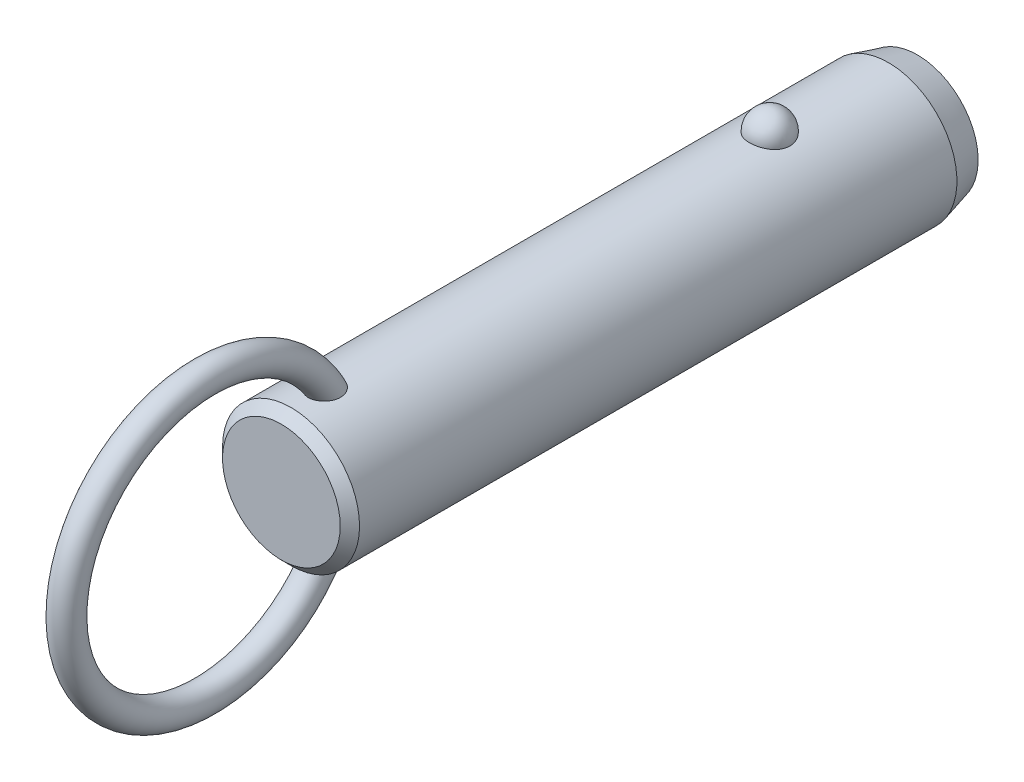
ISO-10303-21;
HEADER;
FILE_DESCRIPTION(('STEP AP214'),'2;1');
FILE_NAME('part.step','',(''),(''),'','','');
FILE_SCHEMA(('AUTOMOTIVE_DESIGN { 1 0 10303 214 1 1 1 1 }'));
ENDSEC;
DATA;
#1=APPLICATION_CONTEXT('core data for automotive mechanical design processes');
#2=APPLICATION_PROTOCOL_DEFINITION('international standard','automotive_design',2000,#1);
#3=PRODUCT_CONTEXT('',#1,'mechanical');
#4=PRODUCT('Part','Part','',(#3));
#5=PRODUCT_RELATED_PRODUCT_CATEGORY('part','',(#4));
#6=PRODUCT_DEFINITION_FORMATION('','',#4);
#7=PRODUCT_DEFINITION_CONTEXT('part definition',#1,'design');
#8=PRODUCT_DEFINITION('design','',#6,#7);
#9=PRODUCT_DEFINITION_SHAPE('','',#8);
#10=(LENGTH_UNIT() NAMED_UNIT(*) SI_UNIT(.MILLI.,.METRE.));
#11=(NAMED_UNIT(*) PLANE_ANGLE_UNIT() SI_UNIT($,.RADIAN.));
#12=(NAMED_UNIT(*) SI_UNIT($,.STERADIAN.) SOLID_ANGLE_UNIT());
#13=UNCERTAINTY_MEASURE_WITH_UNIT(LENGTH_MEASURE(1.E-05),#10,'distance_accuracy_value','');
#14=(GEOMETRIC_REPRESENTATION_CONTEXT(3) GLOBAL_UNCERTAINTY_ASSIGNED_CONTEXT((#13)) GLOBAL_UNIT_ASSIGNED_CONTEXT((#10,
#11,#12)) REPRESENTATION_CONTEXT('',''));
#15=CARTESIAN_POINT('',(0.,0.,0.));
#16=DIRECTION('',(0.,0.,1.));
#17=DIRECTION('',(1.,0.,0.));
#18=AXIS2_PLACEMENT_3D('',#15,#16,#17);
#19=CARTESIAN_POINT('',(0.,0.,40.6));
#20=DIRECTION('',(0.,0.,-1.));
#21=DIRECTION('',(-1.,0.,0.));
#22=AXIS2_PLACEMENT_3D('',#19,#20,#21);
#23=CYLINDRICAL_SURFACE('',#22,7.1);
#24=CARTESIAN_POINT('',(2.0769088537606,6.78943661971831,-2.1));
#25=CARTESIAN_POINT('',(2.07690739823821,6.78943796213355,-1.98268154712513));
#26=CARTESIAN_POINT('',(2.06738130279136,6.79237331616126,-1.86534506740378));
#27=CARTESIAN_POINT('',(2.0295040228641,6.8037853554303,-1.63400788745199));
#28=CARTESIAN_POINT('',(2.00114757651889,6.81226358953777,-1.52000812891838));
#29=CARTESIAN_POINT('',(1.92632025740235,6.83379798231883,-1.29863433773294));
#30=CARTESIAN_POINT('',(1.87985726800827,6.84685214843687,-1.19125744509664));
#31=CARTESIAN_POINT('',(1.76995205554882,6.87608091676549,-0.98604657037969));
#32=CARTESIAN_POINT('',(1.70650980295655,6.8922555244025,-0.88821260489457));
#33=CARTESIAN_POINT('',(1.5638119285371,6.92602930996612,-0.704242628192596));
#34=CARTESIAN_POINT('',(1.4844714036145,6.94363582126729,-0.618173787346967));
#35=CARTESIAN_POINT('',(1.31221746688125,6.97823658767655,-0.460740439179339));
#36=CARTESIAN_POINT('',(1.21930409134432,6.99523084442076,-0.389375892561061));
#37=CARTESIAN_POINT('',(1.02268781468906,7.02666176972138,-0.263547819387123));
#38=CARTESIAN_POINT('',(0.91902009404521,7.04110638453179,-0.209031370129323));
#39=CARTESIAN_POINT('',(0.703548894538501,7.06588726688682,-0.118163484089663));
#40=CARTESIAN_POINT('',(0.591746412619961,7.07622403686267,-0.0818098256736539));
#41=CARTESIAN_POINT('',(0.365557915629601,7.09147068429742,-0.0288711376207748));
#42=CARTESIAN_POINT('',(0.251267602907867,7.09648447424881,-0.0119070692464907));
#43=CARTESIAN_POINT('',(0.0213499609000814,7.10089837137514,0.00304925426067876));
#44=CARTESIAN_POINT('',(-0.0942772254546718,7.10029907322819,0.00104351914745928));
#45=CARTESIAN_POINT('',(-0.321651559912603,7.09360829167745,-0.0216931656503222));
#46=CARTESIAN_POINT('',(-0.433431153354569,7.08760388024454,-0.0421272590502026));
#47=CARTESIAN_POINT('',(-0.651862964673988,7.07086131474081,-0.100729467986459));
#48=CARTESIAN_POINT('',(-0.758515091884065,7.06012307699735,-0.138897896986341));
#49=CARTESIAN_POINT('',(-0.964449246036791,7.03496097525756,-0.232213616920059));
#50=CARTESIAN_POINT('',(-1.06368095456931,7.02051445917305,-0.287465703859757));
#51=CARTESIAN_POINT('',(-1.25145353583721,6.98948740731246,-0.413383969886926));
#52=CARTESIAN_POINT('',(-1.33999321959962,6.97290663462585,-0.48405186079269));
#53=CARTESIAN_POINT('',(-1.50591604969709,6.93898770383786,-0.640594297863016));
#54=CARTESIAN_POINT('',(-1.58302488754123,6.92164094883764,-0.726757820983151));
#55=CARTESIAN_POINT('',(-1.72189320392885,6.8884103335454,-0.91092752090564));
#56=CARTESIAN_POINT('',(-1.78365144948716,6.87252659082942,-1.008934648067));
#57=CARTESIAN_POINT('',(-1.89101272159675,6.84377189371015,-1.21549497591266));
#58=CARTESIAN_POINT('',(-1.93639553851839,6.83094274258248,-1.32416860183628));
#59=CARTESIAN_POINT('',(-2.00874275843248,6.81002070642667,-1.54791500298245));
#60=CARTESIAN_POINT('',(-2.03570774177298,6.80192767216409,-1.66298757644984));
#61=CARTESIAN_POINT('',(-2.07047276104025,6.7914266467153,-1.89571453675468));
#62=CARTESIAN_POINT('',(-2.07835878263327,6.78899315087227,-2.01335491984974));
#63=CARTESIAN_POINT('',(-2.07502083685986,6.79001409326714,-2.24833570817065));
#64=CARTESIAN_POINT('',(-2.06379746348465,6.7934683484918,-2.36567612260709));
#65=CARTESIAN_POINT('',(-2.02263913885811,6.80583442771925,-2.59603194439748));
#66=CARTESIAN_POINT('',(-1.99281127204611,6.81471501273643,-2.70906820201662));
#67=CARTESIAN_POINT('',(-1.91526639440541,6.83691232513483,-2.92836575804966));
#68=CARTESIAN_POINT('',(-1.8675486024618,6.85022924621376,-3.03462676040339));
#69=CARTESIAN_POINT('',(-1.75504492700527,6.87991336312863,-3.23806487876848));
#70=CARTESIAN_POINT('',(-1.69015924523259,6.89629822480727,-3.33518422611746));
#71=CARTESIAN_POINT('',(-1.54505404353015,6.93024852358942,-3.51697105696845));
#72=CARTESIAN_POINT('',(-1.46483385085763,6.94781401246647,-3.60163799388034));
#73=CARTESIAN_POINT('',(-1.29071406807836,6.98225977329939,-3.75654119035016));
#74=CARTESIAN_POINT('',(-1.19675650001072,6.99913673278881,-3.82671308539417));
#75=CARTESIAN_POINT('',(-0.997940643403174,7.03023618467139,-3.9501837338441));
#76=CARTESIAN_POINT('',(-0.89308318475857,7.04445887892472,-4.00348377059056));
#77=CARTESIAN_POINT('',(-0.676902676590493,7.06848365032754,-4.09107242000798));
#78=CARTESIAN_POINT('',(-0.565686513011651,7.0783430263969,-4.12560889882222));
#79=CARTESIAN_POINT('',(-0.338739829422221,7.09282534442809,-4.17575450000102));
#80=CARTESIAN_POINT('',(-0.223009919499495,7.09744899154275,-4.19136617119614));
#81=CARTESIAN_POINT('',(0.00707628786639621,7.10090930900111,-4.20307965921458));
#82=CARTESIAN_POINT('',(0.121410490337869,7.09986531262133,-4.19958377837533));
#83=CARTESIAN_POINT('',(0.347815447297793,7.092380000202,-4.17411564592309));
#84=CARTESIAN_POINT('',(0.459886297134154,7.08593891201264,-4.15214417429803));
#85=CARTESIAN_POINT('',(0.678084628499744,7.06838983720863,-4.09049562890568));
#86=CARTESIAN_POINT('',(0.784237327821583,7.05730369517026,-4.05090137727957));
#87=CARTESIAN_POINT('',(0.988305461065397,7.03163139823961,-3.95511447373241));
#88=CARTESIAN_POINT('',(1.08622031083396,7.01704499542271,-3.89892064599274));
#89=CARTESIAN_POINT('',(1.27284490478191,6.98562668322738,-3.77035541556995));
#90=CARTESIAN_POINT('',(1.36137372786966,6.96876135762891,-3.69772964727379));
#91=CARTESIAN_POINT('',(1.52509486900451,6.93477412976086,-3.53878279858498));
#92=CARTESIAN_POINT('',(1.60028496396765,6.91765218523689,-3.45245943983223));
#93=CARTESIAN_POINT('',(1.73681688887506,6.88465753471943,-3.26658774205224));
#94=CARTESIAN_POINT('',(1.79785966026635,6.86881574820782,-3.16681408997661));
#95=CARTESIAN_POINT('',(1.90265327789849,6.84053157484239,-2.95814408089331));
#96=CARTESIAN_POINT('',(1.94640861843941,6.82808830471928,-2.84925010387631));
#97=CARTESIAN_POINT('',(2.01274378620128,6.80881460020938,-2.63454318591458));
#98=CARTESIAN_POINT('',(2.03676193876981,6.80160856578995,-2.52920574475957));
#99=CARTESIAN_POINT('',(2.06884490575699,6.79191902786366,-2.3159172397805));
#100=CARTESIAN_POINT('',(2.07691019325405,6.78943538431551,-2.20796625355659));
#101=CARTESIAN_POINT('',(2.0769088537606,6.78943661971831,-2.1));
#102=B_SPLINE_CURVE_WITH_KNOTS('',3,(#24,#25,#26,#27,#28,#29,#30,#31,#32,#33,#34,#35,#36,#37,
#38,#39,#40,#41,#42,#43,#44,#45,#46,#47,#48,#49,#50,#51,#52,#53,#54,#55,#56,#57,#58,#59,#60,#61,
#62,#63,#64,#65,#66,#67,#68,#69,#70,#71,#72,#73,#74,#75,#76,#77,#78,#79,#80,#81,#82,#83,#84,#85,
#86,#87,#88,#89,#90,#91,#92,#93,#94,#95,#96,#97,#98,#99,#100,#101),.UNSPECIFIED.,.T.,.F.,(4,2,2,
2,2,2,2,2,2,2,2,2,2,2,2,2,2,2,2,2,2,2,2,2,2,2,2,2,2,2,2,2,2,2,2,2,2,2,4),(0.,0.351568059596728,
0.703234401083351,1.05474780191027,1.40626181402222,1.75970563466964,2.11314851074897,
2.4654696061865,2.81774759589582,3.16301449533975,3.50824481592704,3.84801136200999,
4.18778391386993,4.52968352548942,4.87162112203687,5.22076181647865,5.56993054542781,
5.92363364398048,6.27732559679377,6.62942052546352,6.98150450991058,7.33158042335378,
7.68167162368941,8.03384443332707,8.38603269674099,8.73975272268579,9.09344583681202,
9.44234545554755,9.79119807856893,10.1327344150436,10.4742563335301,10.8141898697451,
11.1541474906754,11.4997793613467,11.8454687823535,12.1979079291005,12.5502553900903,
12.8738073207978,13.1973496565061),.UNSPECIFIED.);
#103=CARTESIAN_POINT('',(2.0769088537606,6.78943661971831,-2.1));
#104=VERTEX_POINT('',#103);
#105=EDGE_CURVE('E41',#104,#104,#102,.T.);
#106=ORIENTED_EDGE('',*,*,#105,.T.);
#107=EDGE_LOOP('',(#106));
#108=FACE_BOUND('',#107,.T.);
#109=CARTESIAN_POINT('',(0.,0.,47.52));
#110=DIRECTION('',(0.,0.,1.));
#111=DIRECTION('',(1.,0.,0.));
#112=AXIS2_PLACEMENT_3D('',#109,#110,#111);
#113=CIRCLE('',#112,7.1);
#114=CARTESIAN_POINT('',(7.1,0.,47.52));
#115=VERTEX_POINT('',#114);
#116=EDGE_CURVE('E10',#115,#115,#113,.F.);
#117=ORIENTED_EDGE('',*,*,#116,.T.);
#118=EDGE_LOOP('',(#117));
#119=FACE_BOUND('',#118,.T.);
#120=CARTESIAN_POINT('',(-0.429539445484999,-7.08699541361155,42.3429212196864));
#121=CARTESIAN_POINT('',(-0.50833166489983,-7.08221999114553,42.3668764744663));
#122=CARTESIAN_POINT('',(-0.585039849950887,-7.07624016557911,42.3974570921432));
#123=CARTESIAN_POINT('',(-0.732082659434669,-7.06254296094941,42.4710242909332));
#124=CARTESIAN_POINT('',(-0.802417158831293,-7.05482554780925,42.5140111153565));
#125=CARTESIAN_POINT('',(-0.934722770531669,-7.03851844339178,42.6111135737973));
#126=CARTESIAN_POINT('',(-0.996700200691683,-7.02992941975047,42.6652207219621));
#127=CARTESIAN_POINT('',(-1.11079942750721,-7.01280697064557,42.7829676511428));
#128=CARTESIAN_POINT('',(-1.16292136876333,-7.00427354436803,42.8466072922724));
#129=CARTESIAN_POINT('',(-1.25705660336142,-6.98799959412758,42.9826870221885));
#130=CARTESIAN_POINT('',(-1.29888032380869,-6.98027525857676,43.0552598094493));
#131=CARTESIAN_POINT('',(-1.37069920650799,-6.96652886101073,43.2061686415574));
#132=CARTESIAN_POINT('',(-1.40069157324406,-6.96050720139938,43.2845060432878));
#133=CARTESIAN_POINT('',(-1.45043507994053,-6.95031881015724,43.4501903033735));
#134=CARTESIAN_POINT('',(-1.46937115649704,-6.94630231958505,43.5377897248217));
#135=CARTESIAN_POINT('',(-1.49424917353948,-6.94099239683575,43.7148714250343));
#136=CARTESIAN_POINT('',(-1.50018601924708,-6.93970003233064,43.8043544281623));
#137=CARTESIAN_POINT('',(-1.49978214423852,-6.93978815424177,43.9940607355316));
#138=CARTESIAN_POINT('',(-1.49187639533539,-6.94150934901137,44.094279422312));
#139=CARTESIAN_POINT('',(-1.46177925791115,-6.94790814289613,44.2924798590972));
#140=CARTESIAN_POINT('',(-1.43957541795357,-6.95258831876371,44.390459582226));
#141=CARTESIAN_POINT('',(-1.37783293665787,-6.96510647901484,44.5953629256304));
#142=CARTESIAN_POINT('',(-1.33634073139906,-6.97328848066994,44.7016801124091));
#143=CARTESIAN_POINT('',(-1.23686994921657,-6.99161706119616,44.9061777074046));
#144=CARTESIAN_POINT('',(-1.17889192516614,-7.00176357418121,45.0043583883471));
#145=CARTESIAN_POINT('',(-1.05875124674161,-7.02082898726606,45.1723743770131));
#146=CARTESIAN_POINT('',(-0.99924764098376,-7.02963746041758,45.2441230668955));
#147=CARTESIAN_POINT('',(-0.86949477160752,-7.04686074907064,45.3771959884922));
#148=CARTESIAN_POINT('',(-0.799263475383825,-7.05527619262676,45.4385372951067));
#149=CARTESIAN_POINT('',(-0.665408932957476,-7.06899457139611,45.5351316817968));
#150=CARTESIAN_POINT('',(-0.603817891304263,-7.07457275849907,45.5731512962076));
#151=CARTESIAN_POINT('',(-0.475172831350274,-7.08437420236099,45.6387581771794));
#152=CARTESIAN_POINT('',(-0.408123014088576,-7.08859848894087,45.6663533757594));
#153=CARTESIAN_POINT('',(-0.269431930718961,-7.09522749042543,45.7092569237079));
#154=CARTESIAN_POINT('',(-0.197757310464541,-7.09761688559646,45.7244618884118));
#155=CARTESIAN_POINT('',(-0.0527849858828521,-7.10017268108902,45.7407168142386));
#156=CARTESIAN_POINT('',(0.0205115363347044,-7.10034065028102,45.7417767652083));
#157=CARTESIAN_POINT('',(0.156426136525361,-7.09855986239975,45.7304619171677));
#158=CARTESIAN_POINT('',(0.219199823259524,-7.09688191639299,45.7198060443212));
#159=CARTESIAN_POINT('',(0.342134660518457,-7.09201880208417,45.6885379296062));
#160=CARTESIAN_POINT('',(0.402295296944,-7.08883333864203,45.6679237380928));
#161=CARTESIAN_POINT('',(0.52068738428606,-7.08113868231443,45.6172125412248));
#162=CARTESIAN_POINT('',(0.57879126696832,-7.07658958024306,45.5868272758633));
#163=CARTESIAN_POINT('',(0.690173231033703,-7.06659708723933,45.5183678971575));
#164=CARTESIAN_POINT('',(0.743447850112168,-7.061153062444,45.4802883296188));
#165=CARTESIAN_POINT('',(0.870947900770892,-7.04680292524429,45.3765929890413));
#166=CARTESIAN_POINT('',(0.941828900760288,-7.0375580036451,45.3068972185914));
#167=CARTESIAN_POINT('',(1.07136606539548,-7.01900793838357,45.1569450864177));
#168=CARTESIAN_POINT('',(1.13000013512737,-7.00970271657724,45.0766700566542));
#169=CARTESIAN_POINT('',(1.23579584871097,-6.99183327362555,44.9068997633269));
#170=CARTESIAN_POINT('',(1.28274271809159,-6.98328455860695,44.8172696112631));
#171=CARTESIAN_POINT('',(1.36351442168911,-6.96796352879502,44.6321763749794));
#172=CARTESIAN_POINT('',(1.39733971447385,-6.96119115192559,44.5367134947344));
#173=CARTESIAN_POINT('',(1.45579181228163,-6.94922464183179,44.3253092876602));
#174=CARTESIAN_POINT('',(1.47790145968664,-6.94449000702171,44.208631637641));
#175=CARTESIAN_POINT('',(1.50168752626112,-6.93938731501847,43.9730153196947));
#176=CARTESIAN_POINT('',(1.50336085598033,-6.93901991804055,43.8540763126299));
#177=CARTESIAN_POINT('',(1.48486516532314,-6.9430010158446,43.6236079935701));
#178=CARTESIAN_POINT('',(1.46573441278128,-6.9471253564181,43.5119958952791));
#179=CARTESIAN_POINT('',(1.40606892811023,-6.95944667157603,43.2948868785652));
#180=CARTESIAN_POINT('',(1.3655644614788,-6.96763788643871,43.1893815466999));
#181=CARTESIAN_POINT('',(1.27082700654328,-6.98548038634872,43.0042879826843));
#182=CARTESIAN_POINT('',(1.21949810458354,-6.99473841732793,42.9231719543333));
#183=CARTESIAN_POINT('',(1.10242050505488,-7.01414069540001,42.7722278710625));
#184=CARTESIAN_POINT('',(1.03668119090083,-7.02428436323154,42.7023925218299));
#185=CARTESIAN_POINT('',(0.900559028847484,-7.04295285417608,42.5835735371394));
#186=CARTESIAN_POINT('',(0.831428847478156,-7.05153466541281,42.5331573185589));
#187=CARTESIAN_POINT('',(0.685291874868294,-7.06723150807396,42.4451429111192));
#188=CARTESIAN_POINT('',(0.608287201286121,-7.0743469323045,42.4075412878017));
#189=CARTESIAN_POINT('',(0.451878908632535,-7.08602232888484,42.3474915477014));
#190=CARTESIAN_POINT('',(0.372686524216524,-7.09067127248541,42.3245088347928));
#191=CARTESIAN_POINT('',(0.211477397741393,-7.09730788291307,42.2920357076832));
#192=CARTESIAN_POINT('',(0.129460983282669,-7.09929585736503,42.2825437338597));
#193=CARTESIAN_POINT('',(-0.0332905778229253,-7.10037858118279,42.2773517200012));
#194=CARTESIAN_POINT('',(-0.114016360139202,-7.09953334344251,42.2813656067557));
#195=CARTESIAN_POINT('',(-0.273670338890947,-7.09517338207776,42.3024540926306));
#196=CARTESIAN_POINT('',(-0.352598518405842,-7.09165863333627,42.3195288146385));
#197=CARTESIAN_POINT('',(-0.429539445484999,-7.08699541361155,42.3429212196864));
#198=B_SPLINE_CURVE_WITH_KNOTS('',3,(#120,#121,#122,#123,#124,#125,#126,#127,#128,#129,#130,
#131,#132,#133,#134,#135,#136,#137,#138,#139,#140,#141,#142,#143,#144,#145,#146,#147,#148,#149,
#150,#151,#152,#153,#154,#155,#156,#157,#158,#159,#160,#161,#162,#163,#164,#165,#166,#167,#168,
#169,#170,#171,#172,#173,#174,#175,#176,#177,#178,#179,#180,#181,#182,#183,#184,#185,#186,#187,
#188,#189,#190,#191,#192,#193,#194,#195,#196,#197),.UNSPECIFIED.,.T.,.F.,(4,2,2,2,2,2,2,2,2,2,2,
2,2,2,2,2,2,2,2,2,2,2,2,2,2,2,2,2,2,2,2,2,2,2,2,2,2,2,4),(0.,0.247183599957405,
0.494372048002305,0.741372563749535,0.988369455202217,1.23962059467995,1.49093106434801,
1.75897818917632,2.02713035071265,2.32758265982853,2.62829697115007,2.9700873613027,
3.31186629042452,3.5917531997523,3.87117637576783,4.08813841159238,4.30493502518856,
4.52352259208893,4.74195577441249,4.93215328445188,5.12238804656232,5.31884850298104,
5.51544871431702,5.81332317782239,6.11173048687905,6.41527266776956,6.71880423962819,
7.07358156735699,7.42841252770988,7.76631485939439,8.10373999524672,8.39142246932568,
8.67891817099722,8.93560332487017,9.19221962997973,9.43881106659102,9.68537399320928,
9.92674752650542,10.1681233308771),.UNSPECIFIED.);
#199=CARTESIAN_POINT('',(-0.429539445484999,-7.08699541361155,42.3429212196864));
#200=VERTEX_POINT('',#199);
#201=EDGE_CURVE('E60',#200,#200,#198,.T.);
#202=ORIENTED_EDGE('',*,*,#201,.T.);
#203=EDGE_LOOP('',(#202));
#204=FACE_BOUND('',#203,.T.);
#205=CARTESIAN_POINT('',(-0.429539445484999,7.08699541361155,42.3429212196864));
#206=CARTESIAN_POINT('',(-0.351665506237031,7.09171429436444,42.3192469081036));
#207=CARTESIAN_POINT('',(-0.271733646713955,7.09525896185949,42.3020369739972));
#208=CARTESIAN_POINT('',(-0.110026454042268,7.09960839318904,42.2810059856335));
#209=CARTESIAN_POINT('',(-0.0282502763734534,7.10041187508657,42.277191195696));
#210=CARTESIAN_POINT('',(0.134782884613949,7.09918849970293,42.283059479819));
#211=CARTESIAN_POINT('',(0.216039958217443,7.09716214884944,42.2927401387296));
#212=CARTESIAN_POINT('',(0.375730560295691,7.09050177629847,42.3253471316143));
#213=CARTESIAN_POINT('',(0.454164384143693,7.08586802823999,42.3482720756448));
#214=CARTESIAN_POINT('',(0.606025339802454,7.07449911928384,42.406771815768));
#215=CARTESIAN_POINT('',(0.679451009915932,7.06776334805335,42.4423502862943));
#216=CARTESIAN_POINT('',(0.819234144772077,7.05292866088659,42.5251753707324));
#217=CARTESIAN_POINT('',(0.885591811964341,7.04482978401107,42.5724216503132));
#218=CARTESIAN_POINT('',(1.00993211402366,7.02808709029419,42.6775902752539));
#219=CARTESIAN_POINT('',(1.06785399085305,7.01943990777,42.735583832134));
#220=CARTESIAN_POINT('',(1.17342527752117,7.00256662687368,42.8603013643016));
#221=CARTESIAN_POINT('',(1.22107408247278,6.99434055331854,42.9270258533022));
#222=CARTESIAN_POINT('',(1.30652927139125,6.97889183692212,43.0693622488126));
#223=CARTESIAN_POINT('',(1.34399711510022,6.97170674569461,43.1451808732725));
#224=CARTESIAN_POINT('',(1.40682616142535,6.95930080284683,43.3018100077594));
#225=CARTESIAN_POINT('',(1.43218374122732,6.95408053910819,43.3826220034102));
#226=CARTESIAN_POINT('',(1.47246409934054,6.94566853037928,43.5535314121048));
#227=CARTESIAN_POINT('',(1.48642590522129,6.9426653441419,43.6438630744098));
#228=CARTESIAN_POINT('',(1.5011410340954,6.93949744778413,43.825619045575));
#229=CARTESIAN_POINT('',(1.50188917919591,6.93933385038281,43.9170437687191));
#230=CARTESIAN_POINT('',(1.49030464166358,6.94183245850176,44.1108438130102));
#231=CARTESIAN_POINT('',(1.47627413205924,6.94486147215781,44.213112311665));
#232=CARTESIAN_POINT('',(1.43356351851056,6.95380194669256,44.4144719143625));
#233=CARTESIAN_POINT('',(1.4048676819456,6.95971650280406,44.5135594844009));
#234=CARTESIAN_POINT('',(1.32908750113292,6.97461208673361,44.7189087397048));
#235=CARTESIAN_POINT('',(1.28011435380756,6.98388945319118,44.8244566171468));
#236=CARTESIAN_POINT('',(1.16520357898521,7.00397743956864,45.0257604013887));
#237=CARTESIAN_POINT('',(1.09927694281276,7.01478706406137,45.1215225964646));
#238=CARTESIAN_POINT('',(0.969361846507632,7.03373936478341,45.2767565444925));
#239=CARTESIAN_POINT('',(0.909042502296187,7.04187023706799,45.3393032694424));
#240=CARTESIAN_POINT('',(0.779178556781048,7.05741732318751,45.4540535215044));
#241=CARTESIAN_POINT('',(0.709649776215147,7.06483472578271,45.5062744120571));
#242=CARTESIAN_POINT('',(0.576854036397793,7.0767751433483,45.5881138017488));
#243=CARTESIAN_POINT('',(0.515118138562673,7.08158033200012,45.6201641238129));
#244=CARTESIAN_POINT('',(0.387127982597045,7.08972701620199,45.6737656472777));
#245=CARTESIAN_POINT('',(0.320877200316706,7.09306962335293,45.6953248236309));
#246=CARTESIAN_POINT('',(0.185041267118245,7.09791507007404,45.7264005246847));
#247=CARTESIAN_POINT('',(0.115437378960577,7.09940591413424,45.7358385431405));
#248=CARTESIAN_POINT('',(-0.0243157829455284,7.10030171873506,45.7415226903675));
#249=CARTESIAN_POINT('',(-0.0944648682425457,7.0997073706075,45.7377731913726));
#250=CARTESIAN_POINT('',(-0.225713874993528,7.09668414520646,45.7185081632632));
#251=CARTESIAN_POINT('',(-0.287006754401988,7.09444865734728,45.7042323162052));
#252=CARTESIAN_POINT('',(-0.406555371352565,7.08860360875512,45.6663685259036));
#253=CARTESIAN_POINT('',(-0.464809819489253,7.08499346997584,45.6427766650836));
#254=CARTESIAN_POINT('',(-0.594955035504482,7.07541654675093,45.5789232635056));
#255=CARTESIAN_POINT('',(-0.665389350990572,7.06906574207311,45.535753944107));
#256=CARTESIAN_POINT('',(-0.798242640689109,7.05530261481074,45.438587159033));
#257=CARTESIAN_POINT('',(-0.860645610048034,7.0478882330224,45.3845686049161));
#258=CARTESIAN_POINT('',(-0.994249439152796,7.03045217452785,45.2509965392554));
#259=CARTESIAN_POINT('',(-1.06260129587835,7.02030745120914,45.1686143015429));
#260=CARTESIAN_POINT('',(-1.18502045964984,7.00068382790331,44.993843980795));
#261=CARTESIAN_POINT('',(-1.23907684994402,6.99120544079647,44.901448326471));
#262=CARTESIAN_POINT('',(-1.33335589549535,6.97384343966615,44.7080085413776));
#263=CARTESIAN_POINT('',(-1.37336138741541,6.96598557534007,44.6068564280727));
#264=CARTESIAN_POINT('',(-1.43770677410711,6.9529905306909,44.3995046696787));
#265=CARTESIAN_POINT('',(-1.46204473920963,6.94785368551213,44.29330440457));
#266=CARTESIAN_POINT('',(-1.49537533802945,6.94076296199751,44.0682317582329));
#267=CARTESIAN_POINT('',(-1.50273564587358,6.93914842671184,43.9490975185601));
#268=CARTESIAN_POINT('',(-1.4954555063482,6.94072368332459,43.7114703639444));
#269=CARTESIAN_POINT('',(-1.48082914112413,6.94391040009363,43.5929770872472));
#270=CARTESIAN_POINT('',(-1.43076401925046,6.95438579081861,43.3734325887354));
#271=CARTESIAN_POINT('',(-1.39762227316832,6.96121852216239,43.2718413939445));
#272=CARTESIAN_POINT('',(-1.31211274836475,6.97783941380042,43.0773513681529));
#273=CARTESIAN_POINT('',(-1.25976607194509,6.98762432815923,42.9844431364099));
#274=CARTESIAN_POINT('',(-1.14583073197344,7.00713153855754,42.8241601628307));
#275=CARTESIAN_POINT('',(-1.08665947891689,7.01665982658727,42.7550351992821));
#276=CARTESIAN_POINT('',(-0.95660664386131,7.03556646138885,42.6288786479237));
#277=CARTESIAN_POINT('',(-0.885737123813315,7.04494495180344,42.5718347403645));
#278=CARTESIAN_POINT('',(-0.75155804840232,7.06035735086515,42.4831004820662));
#279=CARTESIAN_POINT('',(-0.690120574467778,7.0666695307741,42.4485932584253));
#280=CARTESIAN_POINT('',(-0.562815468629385,7.07794609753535,42.3887507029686));
#281=CARTESIAN_POINT('',(-0.496948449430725,7.08291067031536,42.3634141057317));
#282=CARTESIAN_POINT('',(-0.429539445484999,7.08699541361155,42.3429212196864));
#283=B_SPLINE_CURVE_WITH_KNOTS('',3,(#205,#206,#207,#208,#209,#210,#211,#212,#213,#214,#215,
#216,#217,#218,#219,#220,#221,#222,#223,#224,#225,#226,#227,#228,#229,#230,#231,#232,#233,#234,
#235,#236,#237,#238,#239,#240,#241,#242,#243,#244,#245,#246,#247,#248,#249,#250,#251,#252,#253,
#254,#255,#256,#257,#258,#259,#260,#261,#262,#263,#264,#265,#266,#267,#268,#269,#270,#271,#272,
#273,#274,#275,#276,#277,#278,#279,#280,#281,#282),.UNSPECIFIED.,.T.,.F.,(4,2,2,2,2,2,2,2,2,2,2,
2,2,2,2,2,2,2,2,2,2,2,2,2,2,2,2,2,2,2,2,2,2,2,2,2,2,2,4),(0.,0.244335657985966,
0.488785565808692,0.733191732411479,0.977572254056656,1.22202379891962,1.46646834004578,
1.71259457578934,1.9587352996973,2.21226768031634,2.46587585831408,2.7391381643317,
3.01250754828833,3.32109936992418,3.63002293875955,3.9786351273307,4.32702187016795,
4.58793945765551,4.84841449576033,5.05676704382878,5.26496096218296,5.47449661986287,
5.68396281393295,5.87205447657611,6.06022532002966,6.30743751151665,6.55513496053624,
6.87602468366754,7.19715875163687,7.52305774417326,7.84899686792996,8.20516155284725,
8.56109821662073,8.88040084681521,9.19935367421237,9.4723628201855,9.74509220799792,
9.95662250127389,10.1681235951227),.UNSPECIFIED.);
#284=CARTESIAN_POINT('',(-0.429539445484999,7.08699541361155,42.3429212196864));
#285=VERTEX_POINT('',#284);
#286=EDGE_CURVE('E68',#285,#285,#283,.T.);
#287=ORIENTED_EDGE('',*,*,#286,.T.);
#288=EDGE_LOOP('',(#287));
#289=FACE_BOUND('',#288,.T.);
#290=CARTESIAN_POINT('',(0.,0.,-14.3999999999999));
#291=DIRECTION('',(0.,0.,-1.));
#292=DIRECTION('',(-1.,0.,0.));
#293=AXIS2_PLACEMENT_3D('',#290,#291,#292);
#294=CIRCLE('',#293,7.1);
#295=CARTESIAN_POINT('',(-7.1,0.,-14.3999999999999));
#296=VERTEX_POINT('',#295);
#297=EDGE_CURVE('E57',#296,#296,#294,.F.);
#298=ORIENTED_EDGE('',*,*,#297,.T.);
#299=EDGE_LOOP('',(#298));
#300=FACE_BOUND('',#299,.T.);
#301=ADVANCED_FACE('F37',(#108,#119,#204,#289,#300),#23,.T.);
#302=CARTESIAN_POINT('',(0.,0.,-17.4));
#303=DIRECTION('',(0.,0.,-1.));
#304=DIRECTION('',(-1.,0.,0.));
#305=AXIS2_PLACEMENT_3D('',#302,#303,#304);
#306=PLANE('',#305);
#307=CARTESIAN_POINT('',(0.,0.,-17.4));
#308=DIRECTION('',(0.,0.,-1.));
#309=DIRECTION('',(-1.,0.,0.));
#310=AXIS2_PLACEMENT_3D('',#307,#308,#309);
#311=CIRCLE('',#310,6.29615242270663);
#312=CARTESIAN_POINT('',(-6.29615242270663,0.,-17.4));
#313=VERTEX_POINT('',#312);
#314=EDGE_CURVE('E67',#313,#313,#311,.T.);
#315=ORIENTED_EDGE('',*,*,#314,.T.);
#316=EDGE_LOOP('',(#315));
#317=FACE_BOUND('',#316,.T.);
#318=ADVANCED_FACE('F86',(#317),#306,.T.);
#319=CARTESIAN_POINT('',(0.,0.,-17.4));
#320=DIRECTION('',(0.,0.,1.));
#321=DIRECTION('',(1.,0.,0.));
#322=AXIS2_PLACEMENT_3D('',#319,#320,#321);
#323=CONICAL_SURFACE('',#322,6.29615242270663,0.261799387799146);
#324=ORIENTED_EDGE('',*,*,#297,.F.);
#325=EDGE_LOOP('',(#324));
#326=FACE_BOUND('',#325,.T.);
#327=ORIENTED_EDGE('',*,*,#314,.F.);
#328=EDGE_LOOP('',(#327));
#329=FACE_BOUND('',#328,.T.);
#330=ADVANCED_FACE('F84',(#326,#329),#323,.T.);
#331=CARTESIAN_POINT('',(0.,0.,48.52));
#332=DIRECTION('',(0.,0.,1.));
#333=DIRECTION('',(1.,0.,0.));
#334=AXIS2_PLACEMENT_3D('',#331,#332,#333);
#335=PLANE('',#334);
#336=CARTESIAN_POINT('',(0.,0.,48.52));
#337=DIRECTION('',(0.,0.,1.));
#338=DIRECTION('',(1.,0.,0.));
#339=AXIS2_PLACEMENT_3D('',#336,#337,#338);
#340=CIRCLE('',#339,6.10000000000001);
#341=CARTESIAN_POINT('',(6.10000000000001,0.,48.52));
#342=VERTEX_POINT('',#341);
#343=EDGE_CURVE('E50',#342,#342,#340,.T.);
#344=ORIENTED_EDGE('',*,*,#343,.T.);
#345=EDGE_LOOP('',(#344));
#346=FACE_BOUND('',#345,.T.);
#347=ADVANCED_FACE('F78',(#346),#335,.T.);
#348=CARTESIAN_POINT('',(0.,0.,56.45));
#349=DIRECTION('',(1.,0.,0.));
#350=DIRECTION('',(0.,0.,-1.));
#351=AXIS2_PLACEMENT_3D('',#348,#349,#350);
#352=TOROIDAL_SURFACE('',#351,14.35,1.5);
#353=ORIENTED_EDGE('',*,*,#286,.F.);
#354=EDGE_LOOP('',(#353));
#355=FACE_BOUND('',#354,.T.);
#356=ORIENTED_EDGE('',*,*,#201,.F.);
#357=EDGE_LOOP('',(#356));
#358=FACE_BOUND('',#357,.T.);
#359=ADVANCED_FACE('F74',(#355,#358),#352,.T.);
#360=CARTESIAN_POINT('',(0.,0.,48.52));
#361=DIRECTION('',(0.,0.,-1.));
#362=DIRECTION('',(-1.,0.,0.));
#363=AXIS2_PLACEMENT_3D('',#360,#361,#362);
#364=CONICAL_SURFACE('',#363,6.10000000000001,0.785398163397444);
#365=ORIENTED_EDGE('',*,*,#116,.F.);
#366=EDGE_LOOP('',(#365));
#367=FACE_BOUND('',#366,.T.);
#368=ORIENTED_EDGE('',*,*,#343,.F.);
#369=EDGE_LOOP('',(#368));
#370=FACE_BOUND('',#369,.T.);
#371=ADVANCED_FACE('F39',(#367,#370),#364,.T.);
#372=CARTESIAN_POINT('',(0.,7.1,-2.1));
#373=DIRECTION('',(0.,1.,0.));
#374=DIRECTION('',(0.,0.,1.));
#375=AXIS2_PLACEMENT_3D('',#372,#373,#374);
#376=SPHERICAL_SURFACE('',#375,2.10000000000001);
#377=ORIENTED_EDGE('',*,*,#105,.F.);
#378=EDGE_LOOP('',(#377));
#379=FACE_BOUND('',#378,.T.);
#380=ADVANCED_FACE('F80',(#379),#376,.T.);
#381=CLOSED_SHELL('',(#301,#318,#330,#347,#359,#371,#380));
#382=MANIFOLD_SOLID_BREP('B2',#381);
#383=ADVANCED_BREP_SHAPE_REPRESENTATION('',(#18,#382),#14);
#384=SHAPE_DEFINITION_REPRESENTATION(#9,#383);
ENDSEC;
END-ISO-10303-21;
